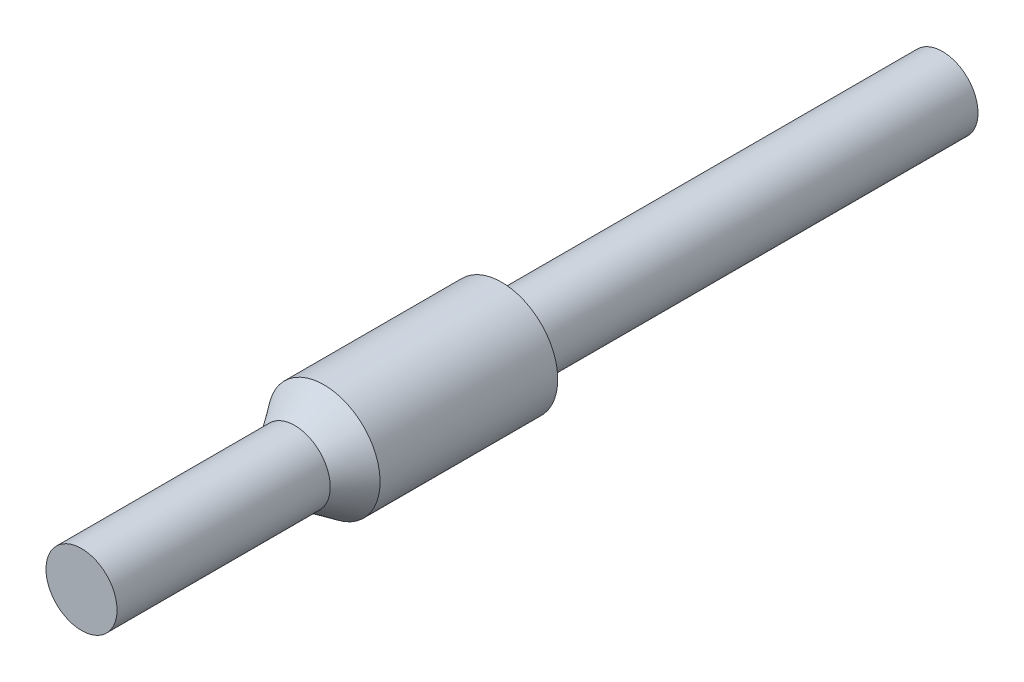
from build123d import *


with BuildPart() as part:
    # Croquis1 → Revoluci_n1 (revolve)
    with BuildSketch(Plane(origin=(0, 0, 0), x_dir=(0, 0, -1), z_dir=(1, 0, 0)), mode=Mode.PRIVATE) as revoluci_n1_sk:
        Polygon((-142.007005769, 0), (-142.007005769, 10), (-82.007005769, 10), (-73.754941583, 15.778157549), (-23.754941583, 15.778157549), (-19.70903211, 10), (100.29096789, 10), (100.29096789, 0), align=None)
    revolve(revoluci_n1_sk.sketch.rotate(Axis((0, 0, 142.007005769), (0, 0, -1)), 180), axis=Axis((0, 0, 142.007005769), (0, 0, -1)))


solid = part.part
